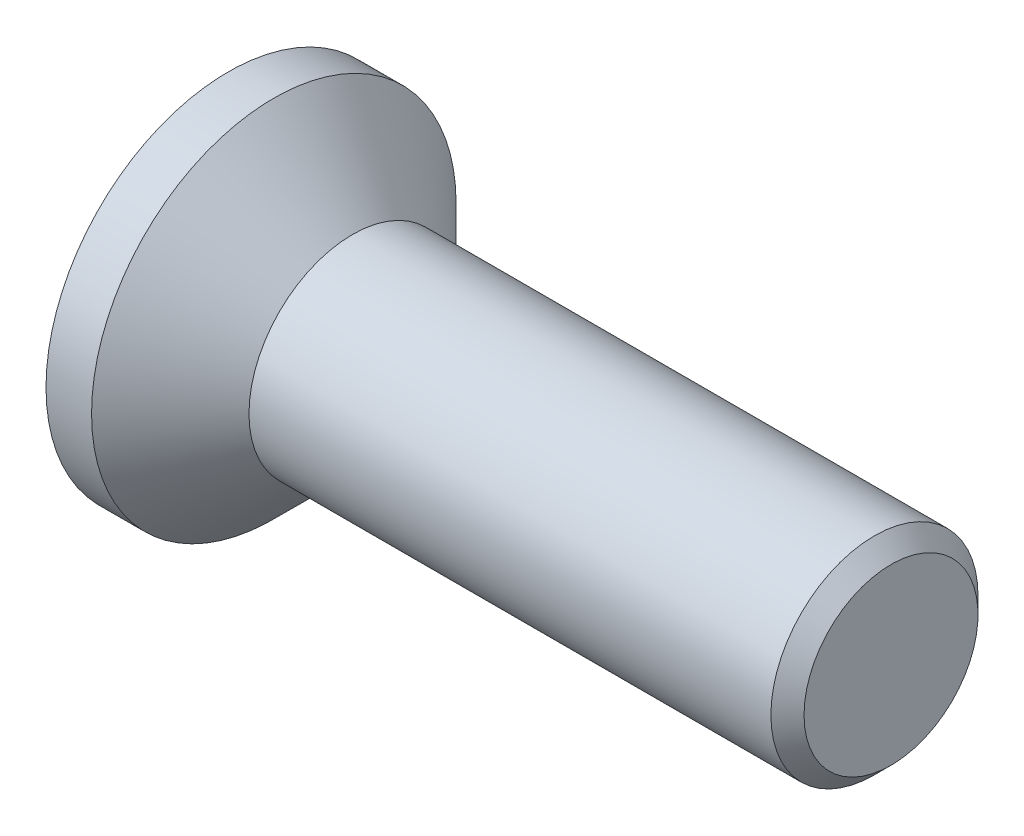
ISO-10303-21;
HEADER;
FILE_DESCRIPTION(('STEP AP214'),'2;1');
FILE_NAME('part.step','',(''),(''),'','','');
FILE_SCHEMA(('AUTOMOTIVE_DESIGN { 1 0 10303 214 1 1 1 1 }'));
ENDSEC;
DATA;
#1=APPLICATION_CONTEXT('core data for automotive mechanical design processes');
#2=APPLICATION_PROTOCOL_DEFINITION('international standard','automotive_design',2000,#1);
#3=PRODUCT_CONTEXT('',#1,'mechanical');
#4=PRODUCT('Part','Part','',(#3));
#5=PRODUCT_RELATED_PRODUCT_CATEGORY('part','',(#4));
#6=PRODUCT_DEFINITION_FORMATION('','',#4);
#7=PRODUCT_DEFINITION_CONTEXT('part definition',#1,'design');
#8=PRODUCT_DEFINITION('design','',#6,#7);
#9=PRODUCT_DEFINITION_SHAPE('','',#8);
#10=(LENGTH_UNIT() NAMED_UNIT(*) SI_UNIT(.MILLI.,.METRE.));
#11=(NAMED_UNIT(*) PLANE_ANGLE_UNIT() SI_UNIT($,.RADIAN.));
#12=(NAMED_UNIT(*) SI_UNIT($,.STERADIAN.) SOLID_ANGLE_UNIT());
#13=UNCERTAINTY_MEASURE_WITH_UNIT(LENGTH_MEASURE(1.E-05),#10,'distance_accuracy_value','');
#14=(GEOMETRIC_REPRESENTATION_CONTEXT(3) GLOBAL_UNCERTAINTY_ASSIGNED_CONTEXT((#13)) GLOBAL_UNIT_ASSIGNED_CONTEXT((#10,
#11,#12)) REPRESENTATION_CONTEXT('',''));
#15=CARTESIAN_POINT('',(0.,0.,0.));
#16=DIRECTION('',(0.,0.,1.));
#17=DIRECTION('',(1.,0.,0.));
#18=AXIS2_PLACEMENT_3D('',#15,#16,#17);
#19=CARTESIAN_POINT('',(4.51581291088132,0.,0.));
#20=DIRECTION('',(1.,0.,0.));
#21=DIRECTION('',(0.,0.,-1.));
#22=AXIS2_PLACEMENT_3D('',#19,#20,#21);
#23=CYLINDRICAL_SURFACE('',#22,1.25);
#24=CARTESIAN_POINT('',(7.8,0.,0.));
#25=DIRECTION('',(1.,0.,0.));
#26=DIRECTION('',(0.,0.,-1.));
#27=AXIS2_PLACEMENT_3D('',#24,#25,#26);
#28=CIRCLE('',#27,1.25);
#29=CARTESIAN_POINT('',(7.8,0.,1.25));
#30=VERTEX_POINT('',#29);
#31=EDGE_CURVE('E11',#30,#30,#28,.F.);
#32=ORIENTED_EDGE('',*,*,#31,.T.);
#33=EDGE_LOOP('',(#32));
#34=FACE_BOUND('',#33,.T.);
#35=CARTESIAN_POINT('',(1.50000000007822,0.,0.));
#36=DIRECTION('',(-1.,0.,0.));
#37=DIRECTION('',(0.,0.,1.));
#38=AXIS2_PLACEMENT_3D('',#35,#36,#37);
#39=CIRCLE('',#38,1.25000000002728);
#40=CARTESIAN_POINT('',(1.50000000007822,0.,1.25000000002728));
#41=VERTEX_POINT('',#40);
#42=EDGE_CURVE('E245',#41,#41,#39,.T.);
#43=ORIENTED_EDGE('',*,*,#42,.F.);
#44=EDGE_LOOP('',(#43));
#45=FACE_BOUND('',#44,.T.);
#46=ADVANCED_FACE('F39',(#34,#45),#23,.T.);
#47=CARTESIAN_POINT('',(0.550000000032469,0.,0.));
#48=DIRECTION('',(-1.,0.,0.));
#49=DIRECTION('',(0.,0.,1.));
#50=AXIS2_PLACEMENT_3D('',#47,#48,#49);
#51=CONICAL_SURFACE('',#50,2.20000000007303,0.785398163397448);
#52=ORIENTED_EDGE('',*,*,#42,.T.);
#53=EDGE_LOOP('',(#52));
#54=FACE_BOUND('',#53,.T.);
#55=CARTESIAN_POINT('',(0.550000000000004,0.,0.));
#56=DIRECTION('',(1.,0.,0.));
#57=DIRECTION('',(0.,0.,-1.));
#58=AXIS2_PLACEMENT_3D('',#55,#56,#57);
#59=CIRCLE('',#58,2.2);
#60=CARTESIAN_POINT('',(0.550000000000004,0.,-2.2));
#61=VERTEX_POINT('',#60);
#62=EDGE_CURVE('E186',#61,#61,#59,.F.);
#63=ORIENTED_EDGE('',*,*,#62,.F.);
#64=EDGE_LOOP('',(#63));
#65=FACE_BOUND('',#64,.T.);
#66=ADVANCED_FACE('F511',(#54,#65),#51,.T.);
#67=CARTESIAN_POINT('',(0.75,0.29,0.29));
#68=DIRECTION('',(1.,0.,0.));
#69=DIRECTION('',(0.,0.,-1.));
#70=AXIS2_PLACEMENT_3D('',#67,#68,#69);
#71=PLANE('',#70);
#72=CARTESIAN_POINT('',(0.75,0.59,0.59));
#73=DIRECTION('',(-1.,0.,0.));
#74=DIRECTION('',(0.,0.,1.));
#75=AXIS2_PLACEMENT_3D('',#72,#73,#74);
#76=CIRCLE('',#75,0.3);
#77=CARTESIAN_POINT('',(0.75,0.59,0.29));
#78=VERTEX_POINT('',#77);
#79=CARTESIAN_POINT('',(0.75,0.29,0.59));
#80=VERTEX_POINT('',#79);
#81=EDGE_CURVE('E271',#78,#80,#76,.T.);
#82=ORIENTED_EDGE('',*,*,#81,.F.);
#83=DIRECTION('',(0.,1.,0.));
#84=VECTOR('',#83,1.);
#85=CARTESIAN_POINT('',(0.75,0.29,0.29));
#86=LINE('',#85,#84);
#87=CARTESIAN_POINT('',(0.75,1.01698729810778,0.29));
#88=VERTEX_POINT('',#87);
#89=EDGE_CURVE('E215',#88,#78,#86,.F.);
#90=ORIENTED_EDGE('',*,*,#89,.F.);
#91=DIRECTION('',(0.,0.,1.));
#92=VECTOR('',#91,1.);
#93=CARTESIAN_POINT('',(0.75,1.01698729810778,-0.29));
#94=LINE('',#93,#92);
#95=CARTESIAN_POINT('',(0.75,1.01698729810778,-0.29));
#96=VERTEX_POINT('',#95);
#97=EDGE_CURVE('E219',#96,#88,#94,.T.);
#98=ORIENTED_EDGE('',*,*,#97,.F.);
#99=DIRECTION('',(0.,1.,0.));
#100=VECTOR('',#99,1.);
#101=CARTESIAN_POINT('',(0.75,0.29,-0.29));
#102=LINE('',#101,#100);
#103=CARTESIAN_POINT('',(0.75,0.59,-0.29));
#104=VERTEX_POINT('',#103);
#105=EDGE_CURVE('E227',#104,#96,#102,.T.);
#106=ORIENTED_EDGE('',*,*,#105,.F.);
#107=CARTESIAN_POINT('',(0.75,0.59,-0.59));
#108=DIRECTION('',(-1.,0.,0.));
#109=DIRECTION('',(0.,0.,1.));
#110=AXIS2_PLACEMENT_3D('',#107,#108,#109);
#111=CIRCLE('',#110,0.3);
#112=CARTESIAN_POINT('',(0.75,0.29,-0.59));
#113=VERTEX_POINT('',#112);
#114=EDGE_CURVE('E274',#113,#104,#111,.T.);
#115=ORIENTED_EDGE('',*,*,#114,.F.);
#116=DIRECTION('',(0.,0.,-1.));
#117=VECTOR('',#116,1.);
#118=CARTESIAN_POINT('',(0.75,0.29,-0.29));
#119=LINE('',#118,#117);
#120=CARTESIAN_POINT('',(0.75,0.29,-1.01698729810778));
#121=VERTEX_POINT('',#120);
#122=EDGE_CURVE('E232',#121,#113,#119,.F.);
#123=ORIENTED_EDGE('',*,*,#122,.F.);
#124=DIRECTION('',(0.,1.,0.));
#125=VECTOR('',#124,1.);
#126=CARTESIAN_POINT('',(0.75,0.29,-1.01698729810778));
#127=LINE('',#126,#125);
#128=CARTESIAN_POINT('',(0.75,-0.29,-1.01698729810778));
#129=VERTEX_POINT('',#128);
#130=EDGE_CURVE('E163',#129,#121,#127,.T.);
#131=ORIENTED_EDGE('',*,*,#130,.F.);
#132=DIRECTION('',(0.,0.,1.));
#133=VECTOR('',#132,1.);
#134=CARTESIAN_POINT('',(0.75,-0.29,-0.29));
#135=LINE('',#134,#133);
#136=CARTESIAN_POINT('',(0.75,-0.29,-0.59));
#137=VERTEX_POINT('',#136);
#138=EDGE_CURVE('E160',#137,#129,#135,.F.);
#139=ORIENTED_EDGE('',*,*,#138,.F.);
#140=CARTESIAN_POINT('',(0.75,-0.59,-0.59));
#141=DIRECTION('',(-1.,0.,0.));
#142=DIRECTION('',(0.,0.,1.));
#143=AXIS2_PLACEMENT_3D('',#140,#141,#142);
#144=CIRCLE('',#143,0.3);
#145=CARTESIAN_POINT('',(0.75,-0.59,-0.29));
#146=VERTEX_POINT('',#145);
#147=EDGE_CURVE('E147',#146,#137,#144,.T.);
#148=ORIENTED_EDGE('',*,*,#147,.F.);
#149=DIRECTION('',(0.,1.,0.));
#150=VECTOR('',#149,1.);
#151=CARTESIAN_POINT('',(0.75,-0.29,-0.29));
#152=LINE('',#151,#150);
#153=CARTESIAN_POINT('',(0.75,-1.01698729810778,-0.29));
#154=VERTEX_POINT('',#153);
#155=EDGE_CURVE('E157',#154,#146,#152,.T.);
#156=ORIENTED_EDGE('',*,*,#155,.F.);
#157=DIRECTION('',(0.,0.,1.));
#158=VECTOR('',#157,1.);
#159=CARTESIAN_POINT('',(0.75,-1.01698729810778,-0.29));
#160=LINE('',#159,#158);
#161=CARTESIAN_POINT('',(0.75,-1.01698729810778,0.29));
#162=VERTEX_POINT('',#161);
#163=EDGE_CURVE('E182',#162,#154,#160,.F.);
#164=ORIENTED_EDGE('',*,*,#163,.F.);
#165=DIRECTION('',(0.,1.,0.));
#166=VECTOR('',#165,1.);
#167=CARTESIAN_POINT('',(0.75,-0.29,0.29));
#168=LINE('',#167,#166);
#169=CARTESIAN_POINT('',(0.75,-0.59,0.29));
#170=VERTEX_POINT('',#169);
#171=EDGE_CURVE('E193',#170,#162,#168,.F.);
#172=ORIENTED_EDGE('',*,*,#171,.F.);
#173=CARTESIAN_POINT('',(0.75,-0.59,0.59));
#174=DIRECTION('',(-1.,0.,0.));
#175=DIRECTION('',(0.,0.,1.));
#176=AXIS2_PLACEMENT_3D('',#173,#174,#175);
#177=CIRCLE('',#176,0.3);
#178=CARTESIAN_POINT('',(0.75,-0.29,0.59));
#179=VERTEX_POINT('',#178);
#180=EDGE_CURVE('E268',#179,#170,#177,.T.);
#181=ORIENTED_EDGE('',*,*,#180,.F.);
#182=DIRECTION('',(0.,0.,1.));
#183=VECTOR('',#182,1.);
#184=CARTESIAN_POINT('',(0.75,-0.29,0.29));
#185=LINE('',#184,#183);
#186=CARTESIAN_POINT('',(0.75,-0.29,1.01698729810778));
#187=VERTEX_POINT('',#186);
#188=EDGE_CURVE('E198',#187,#179,#185,.F.);
#189=ORIENTED_EDGE('',*,*,#188,.F.);
#190=DIRECTION('',(0.,1.,0.));
#191=VECTOR('',#190,1.);
#192=CARTESIAN_POINT('',(0.75,0.29,1.01698729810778));
#193=LINE('',#192,#191);
#194=CARTESIAN_POINT('',(0.75,0.29,1.01698729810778));
#195=VERTEX_POINT('',#194);
#196=EDGE_CURVE('E202',#195,#187,#193,.F.);
#197=ORIENTED_EDGE('',*,*,#196,.F.);
#198=DIRECTION('',(0.,0.,-1.));
#199=VECTOR('',#198,1.);
#200=CARTESIAN_POINT('',(0.75,0.29,0.29));
#201=LINE('',#200,#199);
#202=EDGE_CURVE('E210',#80,#195,#201,.F.);
#203=ORIENTED_EDGE('',*,*,#202,.F.);
#204=EDGE_LOOP('',(#82,#90,#98,#106,#115,#123,#131,#139,#148,#156,#164,#172,#181,#189,#197,#203));
#205=FACE_BOUND('',#204,.T.);
#206=ADVANCED_FACE('F161',(#205),#71,.F.);
#207=CARTESIAN_POINT('',(4.51581291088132,0.,0.));
#208=DIRECTION('',(1.,0.,0.));
#209=DIRECTION('',(0.,0.,-1.));
#210=AXIS2_PLACEMENT_3D('',#207,#208,#209);
#211=CYLINDRICAL_SURFACE('',#210,2.2);
#212=CARTESIAN_POINT('',(0.,0.,0.));
#213=DIRECTION('',(1.,0.,0.));
#214=DIRECTION('',(0.,0.,-1.));
#215=AXIS2_PLACEMENT_3D('',#212,#213,#214);
#216=CIRCLE('',#215,2.2);
#217=CARTESIAN_POINT('',(0.,0.,-2.2));
#218=VERTEX_POINT('',#217);
#219=EDGE_CURVE('E181',#218,#218,#216,.F.);
#220=ORIENTED_EDGE('',*,*,#219,.F.);
#221=EDGE_LOOP('',(#220));
#222=FACE_BOUND('',#221,.T.);
#223=ORIENTED_EDGE('',*,*,#62,.T.);
#224=EDGE_LOOP('',(#223));
#225=FACE_BOUND('',#224,.T.);
#226=ADVANCED_FACE('F482',(#222,#225),#211,.T.);
#227=CARTESIAN_POINT('',(0.75,-0.29,-0.29));
#228=DIRECTION('',(0.,0.,1.));
#229=DIRECTION('',(1.,0.,0.));
#230=AXIS2_PLACEMENT_3D('',#227,#228,#229);
#231=PLANE('',#230);
#232=DIRECTION('',(0.,1.,0.));
#233=VECTOR('',#232,1.);
#234=CARTESIAN_POINT('',(0.,2.2,-0.29));
#235=LINE('',#234,#233);
#236=CARTESIAN_POINT('',(0.,-1.45,-0.29));
#237=VERTEX_POINT('',#236);
#238=CARTESIAN_POINT('',(0.,-0.59,-0.29));
#239=VERTEX_POINT('',#238);
#240=EDGE_CURVE('E265',#237,#239,#235,.T.);
#241=ORIENTED_EDGE('',*,*,#240,.F.);
#242=DIRECTION('',(-0.866025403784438,-0.500000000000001,0.));
#243=VECTOR('',#242,1.);
#244=CARTESIAN_POINT('',(0.,-1.45,-0.29));
#245=LINE('',#244,#243);
#246=EDGE_CURVE('E178',#154,#237,#245,.T.);
#247=ORIENTED_EDGE('',*,*,#246,.F.);
#248=ORIENTED_EDGE('',*,*,#155,.T.);
#249=DIRECTION('',(-1.,0.,0.));
#250=VECTOR('',#249,1.);
#251=CARTESIAN_POINT('',(0.75,-0.59,-0.29));
#252=LINE('',#251,#250);
#253=EDGE_CURVE('E156',#239,#146,#252,.F.);
#254=ORIENTED_EDGE('',*,*,#253,.F.);
#255=EDGE_LOOP('',(#241,#247,#248,#254));
#256=FACE_BOUND('',#255,.T.);
#257=ADVANCED_FACE('F356',(#256),#231,.T.);
#258=CARTESIAN_POINT('',(0.75,-0.59,-0.59));
#259=DIRECTION('',(-1.,0.,0.));
#260=DIRECTION('',(0.,0.,1.));
#261=AXIS2_PLACEMENT_3D('',#258,#259,#260);
#262=CYLINDRICAL_SURFACE('',#261,0.3);
#263=CARTESIAN_POINT('',(0.,-0.59,-0.59));
#264=DIRECTION('',(-1.,0.,0.));
#265=DIRECTION('',(0.,0.,1.));
#266=AXIS2_PLACEMENT_3D('',#263,#264,#265);
#267=CIRCLE('',#266,0.3);
#268=CARTESIAN_POINT('',(0.,-0.29,-0.59));
#269=VERTEX_POINT('',#268);
#270=EDGE_CURVE('E263',#239,#269,#267,.T.);
#271=ORIENTED_EDGE('',*,*,#270,.F.);
#272=ORIENTED_EDGE('',*,*,#253,.T.);
#273=ORIENTED_EDGE('',*,*,#147,.T.);
#274=DIRECTION('',(1.,0.,0.));
#275=VECTOR('',#274,1.);
#276=CARTESIAN_POINT('',(0.75,-0.29,-0.59));
#277=LINE('',#276,#275);
#278=EDGE_CURVE('E154',#269,#137,#277,.T.);
#279=ORIENTED_EDGE('',*,*,#278,.F.);
#280=EDGE_LOOP('',(#271,#272,#273,#279));
#281=FACE_BOUND('',#280,.T.);
#282=ADVANCED_FACE('F152',(#281),#262,.T.);
#283=CARTESIAN_POINT('',(0.75,-0.29,-0.29));
#284=DIRECTION('',(0.,1.,0.));
#285=DIRECTION('',(0.,0.,1.));
#286=AXIS2_PLACEMENT_3D('',#283,#284,#285);
#287=PLANE('',#286);
#288=ORIENTED_EDGE('',*,*,#138,.T.);
#289=DIRECTION('',(0.866025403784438,0.,0.500000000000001));
#290=VECTOR('',#289,1.);
#291=CARTESIAN_POINT('',(0.,-0.29,-1.45));
#292=LINE('',#291,#290);
#293=CARTESIAN_POINT('',(0.,-0.29,-1.45));
#294=VERTEX_POINT('',#293);
#295=EDGE_CURVE('E166',#294,#129,#292,.T.);
#296=ORIENTED_EDGE('',*,*,#295,.F.);
#297=DIRECTION('',(0.,0.,1.));
#298=VECTOR('',#297,1.);
#299=CARTESIAN_POINT('',(0.,-0.29,0.));
#300=LINE('',#299,#298);
#301=EDGE_CURVE('E170',#269,#294,#300,.F.);
#302=ORIENTED_EDGE('',*,*,#301,.F.);
#303=ORIENTED_EDGE('',*,*,#278,.T.);
#304=EDGE_LOOP('',(#288,#296,#302,#303));
#305=FACE_BOUND('',#304,.T.);
#306=ADVANCED_FACE('F168',(#305),#287,.T.);
#307=CARTESIAN_POINT('',(0.,0.29,-1.45));
#308=DIRECTION('',(-0.500000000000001,0.,0.866025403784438));
#309=DIRECTION('',(0.866025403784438,0.,0.500000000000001));
#310=AXIS2_PLACEMENT_3D('',#307,#308,#309);
#311=PLANE('',#310);
#312=ORIENTED_EDGE('',*,*,#130,.T.);
#313=DIRECTION('',(0.866025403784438,0.,0.500000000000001));
#314=VECTOR('',#313,1.);
#315=CARTESIAN_POINT('',(0.,0.29,-1.45));
#316=LINE('',#315,#314);
#317=CARTESIAN_POINT('',(0.,0.29,-1.45));
#318=VERTEX_POINT('',#317);
#319=EDGE_CURVE('E235',#318,#121,#316,.T.);
#320=ORIENTED_EDGE('',*,*,#319,.F.);
#321=DIRECTION('',(0.,1.,0.));
#322=VECTOR('',#321,1.);
#323=CARTESIAN_POINT('',(0.,2.2,-1.45));
#324=LINE('',#323,#322);
#325=EDGE_CURVE('E334',#294,#318,#324,.T.);
#326=ORIENTED_EDGE('',*,*,#325,.F.);
#327=ORIENTED_EDGE('',*,*,#295,.T.);
#328=EDGE_LOOP('',(#312,#320,#326,#327));
#329=FACE_BOUND('',#328,.T.);
#330=ADVANCED_FACE('F340',(#329),#311,.T.);
#331=CARTESIAN_POINT('',(0.75,0.29,-0.29));
#332=DIRECTION('',(0.,-1.,0.));
#333=DIRECTION('',(0.,0.,-1.));
#334=AXIS2_PLACEMENT_3D('',#331,#332,#333);
#335=PLANE('',#334);
#336=DIRECTION('',(0.,0.,1.));
#337=VECTOR('',#336,1.);
#338=CARTESIAN_POINT('',(0.,0.29,0.));
#339=LINE('',#338,#337);
#340=CARTESIAN_POINT('',(0.,0.29,-0.59));
#341=VERTEX_POINT('',#340);
#342=EDGE_CURVE('E262',#318,#341,#339,.T.);
#343=ORIENTED_EDGE('',*,*,#342,.F.);
#344=ORIENTED_EDGE('',*,*,#319,.T.);
#345=ORIENTED_EDGE('',*,*,#122,.T.);
#346=DIRECTION('',(-1.,0.,0.));
#347=VECTOR('',#346,1.);
#348=CARTESIAN_POINT('',(0.75,0.29,-0.59));
#349=LINE('',#348,#347);
#350=EDGE_CURVE('E275',#341,#113,#349,.F.);
#351=ORIENTED_EDGE('',*,*,#350,.F.);
#352=EDGE_LOOP('',(#343,#344,#345,#351));
#353=FACE_BOUND('',#352,.T.);
#354=ADVANCED_FACE('F400',(#353),#335,.T.);
#355=CARTESIAN_POINT('',(0.75,0.59,-0.59));
#356=DIRECTION('',(-1.,0.,0.));
#357=DIRECTION('',(0.,0.,1.));
#358=AXIS2_PLACEMENT_3D('',#355,#356,#357);
#359=CYLINDRICAL_SURFACE('',#358,0.3);
#360=CARTESIAN_POINT('',(0.,0.59,-0.59));
#361=DIRECTION('',(-1.,0.,0.));
#362=DIRECTION('',(0.,0.,1.));
#363=AXIS2_PLACEMENT_3D('',#360,#361,#362);
#364=CIRCLE('',#363,0.3);
#365=CARTESIAN_POINT('',(0.,0.59,-0.29));
#366=VERTEX_POINT('',#365);
#367=EDGE_CURVE('E258',#341,#366,#364,.T.);
#368=ORIENTED_EDGE('',*,*,#367,.F.);
#369=ORIENTED_EDGE('',*,*,#350,.T.);
#370=ORIENTED_EDGE('',*,*,#114,.T.);
#371=DIRECTION('',(1.,0.,0.));
#372=VECTOR('',#371,1.);
#373=CARTESIAN_POINT('',(0.75,0.59,-0.29));
#374=LINE('',#373,#372);
#375=EDGE_CURVE('E229',#366,#104,#374,.T.);
#376=ORIENTED_EDGE('',*,*,#375,.F.);
#377=EDGE_LOOP('',(#368,#369,#370,#376));
#378=FACE_BOUND('',#377,.T.);
#379=ADVANCED_FACE('F402',(#378),#359,.T.);
#380=CARTESIAN_POINT('',(0.75,0.29,-0.29));
#381=DIRECTION('',(0.,0.,1.));
#382=DIRECTION('',(1.,0.,0.));
#383=AXIS2_PLACEMENT_3D('',#380,#381,#382);
#384=PLANE('',#383);
#385=ORIENTED_EDGE('',*,*,#105,.T.);
#386=DIRECTION('',(0.866025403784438,-0.500000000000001,0.));
#387=VECTOR('',#386,1.);
#388=CARTESIAN_POINT('',(0.,1.45,-0.29));
#389=LINE('',#388,#387);
#390=CARTESIAN_POINT('',(0.,1.45,-0.29));
#391=VERTEX_POINT('',#390);
#392=EDGE_CURVE('E224',#391,#96,#389,.T.);
#393=ORIENTED_EDGE('',*,*,#392,.F.);
#394=DIRECTION('',(0.,1.,0.));
#395=VECTOR('',#394,1.);
#396=CARTESIAN_POINT('',(0.,2.2,-0.29));
#397=LINE('',#396,#395);
#398=EDGE_CURVE('E261',#366,#391,#397,.T.);
#399=ORIENTED_EDGE('',*,*,#398,.F.);
#400=ORIENTED_EDGE('',*,*,#375,.T.);
#401=EDGE_LOOP('',(#385,#393,#399,#400));
#402=FACE_BOUND('',#401,.T.);
#403=ADVANCED_FACE('F406',(#402),#384,.T.);
#404=CARTESIAN_POINT('',(0.,1.45,-0.29));
#405=DIRECTION('',(-0.500000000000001,-0.866025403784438,0.));
#406=DIRECTION('',(0.866025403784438,-0.500000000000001,0.));
#407=AXIS2_PLACEMENT_3D('',#404,#405,#406);
#408=PLANE('',#407);
#409=ORIENTED_EDGE('',*,*,#97,.T.);
#410=DIRECTION('',(0.866025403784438,-0.500000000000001,0.));
#411=VECTOR('',#410,1.);
#412=CARTESIAN_POINT('',(0.,1.45,0.29));
#413=LINE('',#412,#411);
#414=CARTESIAN_POINT('',(0.,1.45,0.29));
#415=VERTEX_POINT('',#414);
#416=EDGE_CURVE('E218',#415,#88,#413,.T.);
#417=ORIENTED_EDGE('',*,*,#416,.F.);
#418=DIRECTION('',(0.,0.,1.));
#419=VECTOR('',#418,1.);
#420=CARTESIAN_POINT('',(0.,1.45,0.));
#421=LINE('',#420,#419);
#422=EDGE_CURVE('E317',#391,#415,#421,.T.);
#423=ORIENTED_EDGE('',*,*,#422,.F.);
#424=ORIENTED_EDGE('',*,*,#392,.T.);
#425=EDGE_LOOP('',(#409,#417,#423,#424));
#426=FACE_BOUND('',#425,.T.);
#427=ADVANCED_FACE('F408',(#426),#408,.T.);
#428=CARTESIAN_POINT('',(0.75,0.29,0.29));
#429=DIRECTION('',(0.,0.,-1.));
#430=DIRECTION('',(0.,1.,0.));
#431=AXIS2_PLACEMENT_3D('',#428,#429,#430);
#432=PLANE('',#431);
#433=DIRECTION('',(0.,1.,0.));
#434=VECTOR('',#433,1.);
#435=CARTESIAN_POINT('',(0.,2.2,0.29));
#436=LINE('',#435,#434);
#437=CARTESIAN_POINT('',(0.,0.59,0.29));
#438=VERTEX_POINT('',#437);
#439=EDGE_CURVE('E257',#415,#438,#436,.F.);
#440=ORIENTED_EDGE('',*,*,#439,.F.);
#441=ORIENTED_EDGE('',*,*,#416,.T.);
#442=ORIENTED_EDGE('',*,*,#89,.T.);
#443=DIRECTION('',(-1.,0.,0.));
#444=VECTOR('',#443,1.);
#445=CARTESIAN_POINT('',(0.75,0.59,0.29));
#446=LINE('',#445,#444);
#447=EDGE_CURVE('E273',#438,#78,#446,.F.);
#448=ORIENTED_EDGE('',*,*,#447,.F.);
#449=EDGE_LOOP('',(#440,#441,#442,#448));
#450=FACE_BOUND('',#449,.T.);
#451=ADVANCED_FACE('F383',(#450),#432,.T.);
#452=CARTESIAN_POINT('',(0.75,0.59,0.59));
#453=DIRECTION('',(-1.,0.,0.));
#454=DIRECTION('',(0.,0.,1.));
#455=AXIS2_PLACEMENT_3D('',#452,#453,#454);
#456=CYLINDRICAL_SURFACE('',#455,0.3);
#457=CARTESIAN_POINT('',(0.,0.59,0.59));
#458=DIRECTION('',(-1.,0.,0.));
#459=DIRECTION('',(0.,0.,1.));
#460=AXIS2_PLACEMENT_3D('',#457,#458,#459);
#461=CIRCLE('',#460,0.3);
#462=CARTESIAN_POINT('',(0.,0.29,0.59));
#463=VERTEX_POINT('',#462);
#464=EDGE_CURVE('E253',#438,#463,#461,.T.);
#465=ORIENTED_EDGE('',*,*,#464,.F.);
#466=ORIENTED_EDGE('',*,*,#447,.T.);
#467=ORIENTED_EDGE('',*,*,#81,.T.);
#468=DIRECTION('',(1.,0.,0.));
#469=VECTOR('',#468,1.);
#470=CARTESIAN_POINT('',(0.75,0.29,0.59));
#471=LINE('',#470,#469);
#472=EDGE_CURVE('E212',#463,#80,#471,.T.);
#473=ORIENTED_EDGE('',*,*,#472,.F.);
#474=EDGE_LOOP('',(#465,#466,#467,#473));
#475=FACE_BOUND('',#474,.T.);
#476=ADVANCED_FACE('F385',(#475),#456,.T.);
#477=CARTESIAN_POINT('',(0.75,0.29,0.29));
#478=DIRECTION('',(0.,-1.,0.));
#479=DIRECTION('',(0.,0.,-1.));
#480=AXIS2_PLACEMENT_3D('',#477,#478,#479);
#481=PLANE('',#480);
#482=ORIENTED_EDGE('',*,*,#202,.T.);
#483=DIRECTION('',(-0.866025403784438,0.,0.500000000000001));
#484=VECTOR('',#483,1.);
#485=CARTESIAN_POINT('',(0.,0.29,1.45));
#486=LINE('',#485,#484);
#487=CARTESIAN_POINT('',(0.,0.29,1.45));
#488=VERTEX_POINT('',#487);
#489=EDGE_CURVE('E207',#488,#195,#486,.F.);
#490=ORIENTED_EDGE('',*,*,#489,.F.);
#491=DIRECTION('',(0.,0.,1.));
#492=VECTOR('',#491,1.);
#493=CARTESIAN_POINT('',(0.,0.29,0.));
#494=LINE('',#493,#492);
#495=EDGE_CURVE('E256',#463,#488,#494,.T.);
#496=ORIENTED_EDGE('',*,*,#495,.F.);
#497=ORIENTED_EDGE('',*,*,#472,.T.);
#498=EDGE_LOOP('',(#482,#490,#496,#497));
#499=FACE_BOUND('',#498,.T.);
#500=ADVANCED_FACE('F378',(#499),#481,.T.);
#501=CARTESIAN_POINT('',(0.,0.29,1.45));
#502=DIRECTION('',(-0.500000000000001,0.,-0.866025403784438));
#503=DIRECTION('',(-0.866025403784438,0.,0.500000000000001));
#504=AXIS2_PLACEMENT_3D('',#501,#502,#503);
#505=PLANE('',#504);
#506=ORIENTED_EDGE('',*,*,#196,.T.);
#507=DIRECTION('',(0.866025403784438,0.,-0.500000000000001));
#508=VECTOR('',#507,1.);
#509=CARTESIAN_POINT('',(0.,-0.29,1.45));
#510=LINE('',#509,#508);
#511=CARTESIAN_POINT('',(0.,-0.29,1.45));
#512=VERTEX_POINT('',#511);
#513=EDGE_CURVE('E201',#512,#187,#510,.T.);
#514=ORIENTED_EDGE('',*,*,#513,.F.);
#515=DIRECTION('',(0.,1.,0.));
#516=VECTOR('',#515,1.);
#517=CARTESIAN_POINT('',(0.,2.2,1.45));
#518=LINE('',#517,#516);
#519=EDGE_CURVE('E300',#488,#512,#518,.F.);
#520=ORIENTED_EDGE('',*,*,#519,.F.);
#521=ORIENTED_EDGE('',*,*,#489,.T.);
#522=EDGE_LOOP('',(#506,#514,#520,#521));
#523=FACE_BOUND('',#522,.T.);
#524=ADVANCED_FACE('F373',(#523),#505,.T.);
#525=CARTESIAN_POINT('',(0.75,-0.29,0.29));
#526=DIRECTION('',(0.,1.,0.));
#527=DIRECTION('',(0.,0.,1.));
#528=AXIS2_PLACEMENT_3D('',#525,#526,#527);
#529=PLANE('',#528);
#530=DIRECTION('',(0.,0.,1.));
#531=VECTOR('',#530,1.);
#532=CARTESIAN_POINT('',(0.,-0.29,0.));
#533=LINE('',#532,#531);
#534=CARTESIAN_POINT('',(0.,-0.29,0.59));
#535=VERTEX_POINT('',#534);
#536=EDGE_CURVE('E252',#512,#535,#533,.F.);
#537=ORIENTED_EDGE('',*,*,#536,.F.);
#538=ORIENTED_EDGE('',*,*,#513,.T.);
#539=ORIENTED_EDGE('',*,*,#188,.T.);
#540=DIRECTION('',(-1.,0.,0.));
#541=VECTOR('',#540,1.);
#542=CARTESIAN_POINT('',(0.75,-0.29,0.59));
#543=LINE('',#542,#541);
#544=EDGE_CURVE('E270',#535,#179,#543,.F.);
#545=ORIENTED_EDGE('',*,*,#544,.F.);
#546=EDGE_LOOP('',(#537,#538,#539,#545));
#547=FACE_BOUND('',#546,.T.);
#548=ADVANCED_FACE('F369',(#547),#529,.T.);
#549=CARTESIAN_POINT('',(0.75,-0.59,0.59));
#550=DIRECTION('',(-1.,0.,0.));
#551=DIRECTION('',(0.,0.,1.));
#552=AXIS2_PLACEMENT_3D('',#549,#550,#551);
#553=CYLINDRICAL_SURFACE('',#552,0.3);
#554=CARTESIAN_POINT('',(0.,-0.59,0.59));
#555=DIRECTION('',(-1.,0.,0.));
#556=DIRECTION('',(0.,0.,1.));
#557=AXIS2_PLACEMENT_3D('',#554,#555,#556);
#558=CIRCLE('',#557,0.3);
#559=CARTESIAN_POINT('',(0.,-0.59,0.29));
#560=VERTEX_POINT('',#559);
#561=EDGE_CURVE('E248',#535,#560,#558,.T.);
#562=ORIENTED_EDGE('',*,*,#561,.F.);
#563=ORIENTED_EDGE('',*,*,#544,.T.);
#564=ORIENTED_EDGE('',*,*,#180,.T.);
#565=DIRECTION('',(1.,0.,0.));
#566=VECTOR('',#565,1.);
#567=CARTESIAN_POINT('',(0.75,-0.59,0.29));
#568=LINE('',#567,#566);
#569=EDGE_CURVE('E195',#560,#170,#568,.T.);
#570=ORIENTED_EDGE('',*,*,#569,.F.);
#571=EDGE_LOOP('',(#562,#563,#564,#570));
#572=FACE_BOUND('',#571,.T.);
#573=ADVANCED_FACE('F365',(#572),#553,.T.);
#574=CARTESIAN_POINT('',(0.75,-0.29,0.29));
#575=DIRECTION('',(0.,0.,-1.));
#576=DIRECTION('',(0.,1.,0.));
#577=AXIS2_PLACEMENT_3D('',#574,#575,#576);
#578=PLANE('',#577);
#579=ORIENTED_EDGE('',*,*,#171,.T.);
#580=DIRECTION('',(-0.866025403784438,-0.500000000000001,0.));
#581=VECTOR('',#580,1.);
#582=CARTESIAN_POINT('',(0.,-1.45,0.289999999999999));
#583=LINE('',#582,#581);
#584=CARTESIAN_POINT('',(0.,-1.45,0.29));
#585=VERTEX_POINT('',#584);
#586=EDGE_CURVE('E56',#585,#162,#583,.F.);
#587=ORIENTED_EDGE('',*,*,#586,.F.);
#588=DIRECTION('',(0.,1.,0.));
#589=VECTOR('',#588,1.);
#590=CARTESIAN_POINT('',(0.,2.2,0.29));
#591=LINE('',#590,#589);
#592=EDGE_CURVE('E251',#560,#585,#591,.F.);
#593=ORIENTED_EDGE('',*,*,#592,.F.);
#594=ORIENTED_EDGE('',*,*,#569,.T.);
#595=EDGE_LOOP('',(#579,#587,#593,#594));
#596=FACE_BOUND('',#595,.T.);
#597=ADVANCED_FACE('F362',(#596),#578,.T.);
#598=CARTESIAN_POINT('',(0.,-1.45,-0.29));
#599=DIRECTION('',(-0.500000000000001,0.866025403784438,0.));
#600=DIRECTION('',(-0.866025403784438,-0.500000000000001,0.));
#601=AXIS2_PLACEMENT_3D('',#598,#599,#600);
#602=PLANE('',#601);
#603=ORIENTED_EDGE('',*,*,#163,.T.);
#604=ORIENTED_EDGE('',*,*,#246,.T.);
#605=DIRECTION('',(0.,0.,1.));
#606=VECTOR('',#605,1.);
#607=CARTESIAN_POINT('',(0.,-1.45,0.));
#608=LINE('',#607,#606);
#609=EDGE_CURVE('E277',#585,#237,#608,.F.);
#610=ORIENTED_EDGE('',*,*,#609,.F.);
#611=ORIENTED_EDGE('',*,*,#586,.T.);
#612=EDGE_LOOP('',(#603,#604,#610,#611));
#613=FACE_BOUND('',#612,.T.);
#614=ADVANCED_FACE('F358',(#613),#602,.T.);
#615=CARTESIAN_POINT('',(0.,2.2,0.));
#616=DIRECTION('',(-1.,0.,0.));
#617=DIRECTION('',(0.,0.,1.));
#618=AXIS2_PLACEMENT_3D('',#615,#616,#617);
#619=PLANE('',#618);
#620=ORIENTED_EDGE('',*,*,#592,.T.);
#621=ORIENTED_EDGE('',*,*,#609,.T.);
#622=ORIENTED_EDGE('',*,*,#240,.T.);
#623=ORIENTED_EDGE('',*,*,#270,.T.);
#624=ORIENTED_EDGE('',*,*,#301,.T.);
#625=ORIENTED_EDGE('',*,*,#325,.T.);
#626=ORIENTED_EDGE('',*,*,#342,.T.);
#627=ORIENTED_EDGE('',*,*,#367,.T.);
#628=ORIENTED_EDGE('',*,*,#398,.T.);
#629=ORIENTED_EDGE('',*,*,#422,.T.);
#630=ORIENTED_EDGE('',*,*,#439,.T.);
#631=ORIENTED_EDGE('',*,*,#464,.T.);
#632=ORIENTED_EDGE('',*,*,#495,.T.);
#633=ORIENTED_EDGE('',*,*,#519,.T.);
#634=ORIENTED_EDGE('',*,*,#536,.T.);
#635=ORIENTED_EDGE('',*,*,#561,.T.);
#636=EDGE_LOOP('',(#620,#621,#622,#623,#624,#625,#626,#627,#628,#629,#630,#631,#632,#633,#634,#635));
#637=FACE_BOUND('',#636,.T.);
#638=ORIENTED_EDGE('',*,*,#219,.T.);
#639=EDGE_LOOP('',(#638));
#640=FACE_BOUND('',#639,.T.);
#641=ADVANCED_FACE('F343',(#637,#640),#619,.T.);
#642=CARTESIAN_POINT('',(8.,0.,0.));
#643=DIRECTION('',(1.,0.,0.));
#644=DIRECTION('',(0.,0.,-1.));
#645=AXIS2_PLACEMENT_3D('',#642,#643,#644);
#646=PLANE('',#645);
#647=CARTESIAN_POINT('',(8.,0.,0.));
#648=DIRECTION('',(1.,0.,0.));
#649=DIRECTION('',(0.,0.,-1.));
#650=AXIS2_PLACEMENT_3D('',#647,#648,#649);
#651=CIRCLE('',#650,1.05);
#652=CARTESIAN_POINT('',(8.,0.,1.05));
#653=VERTEX_POINT('',#652);
#654=EDGE_CURVE('E48',#653,#653,#651,.T.);
#655=ORIENTED_EDGE('',*,*,#654,.T.);
#656=EDGE_LOOP('',(#655));
#657=FACE_BOUND('',#656,.T.);
#658=ADVANCED_FACE('F418',(#657),#646,.T.);
#659=CARTESIAN_POINT('',(8.,0.,0.));
#660=DIRECTION('',(-1.,0.,0.));
#661=DIRECTION('',(0.,0.,1.));
#662=AXIS2_PLACEMENT_3D('',#659,#660,#661);
#663=CONICAL_SURFACE('',#662,1.05,0.785398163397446);
#664=CARTESIAN_POINT('',(7.8,0.,1.25));
#665=CARTESIAN_POINT('',(7.80208333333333,0.,1.24791666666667));
#666=CARTESIAN_POINT('',(7.80416666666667,0.,1.24583333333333));
#667=CARTESIAN_POINT('',(7.80833333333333,0.,1.24166666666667));
#668=CARTESIAN_POINT('',(7.81041666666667,0.,1.23958333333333));
#669=CARTESIAN_POINT('',(7.81458333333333,0.,1.23541666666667));
#670=CARTESIAN_POINT('',(7.81666666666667,0.,1.23333333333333));
#671=CARTESIAN_POINT('',(7.82083333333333,0.,1.22916666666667));
#672=CARTESIAN_POINT('',(7.82291666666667,0.,1.22708333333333));
#673=CARTESIAN_POINT('',(7.82708333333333,0.,1.22291666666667));
#674=CARTESIAN_POINT('',(7.82916666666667,0.,1.22083333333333));
#675=CARTESIAN_POINT('',(7.83333333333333,0.,1.21666666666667));
#676=CARTESIAN_POINT('',(7.83541666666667,0.,1.21458333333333));
#677=CARTESIAN_POINT('',(7.83958333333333,0.,1.21041666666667));
#678=CARTESIAN_POINT('',(7.84166666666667,0.,1.20833333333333));
#679=CARTESIAN_POINT('',(7.84583333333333,0.,1.20416666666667));
#680=CARTESIAN_POINT('',(7.84791666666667,0.,1.20208333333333));
#681=CARTESIAN_POINT('',(7.85208333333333,0.,1.19791666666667));
#682=CARTESIAN_POINT('',(7.85416666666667,0.,1.19583333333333));
#683=CARTESIAN_POINT('',(7.85833333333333,0.,1.19166666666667));
#684=CARTESIAN_POINT('',(7.86041666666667,0.,1.18958333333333));
#685=CARTESIAN_POINT('',(7.86458333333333,0.,1.18541666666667));
#686=CARTESIAN_POINT('',(7.86666666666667,0.,1.18333333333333));
#687=CARTESIAN_POINT('',(7.87083333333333,0.,1.17916666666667));
#688=CARTESIAN_POINT('',(7.87291666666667,0.,1.17708333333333));
#689=CARTESIAN_POINT('',(7.87708333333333,0.,1.17291666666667));
#690=CARTESIAN_POINT('',(7.87916666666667,0.,1.17083333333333));
#691=CARTESIAN_POINT('',(7.88333333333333,0.,1.16666666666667));
#692=CARTESIAN_POINT('',(7.88541666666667,0.,1.16458333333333));
#693=CARTESIAN_POINT('',(7.88958333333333,0.,1.16041666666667));
#694=CARTESIAN_POINT('',(7.89166666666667,0.,1.15833333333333));
#695=CARTESIAN_POINT('',(7.89583333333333,0.,1.15416666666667));
#696=CARTESIAN_POINT('',(7.89791666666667,0.,1.15208333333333));
#697=CARTESIAN_POINT('',(7.90208333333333,0.,1.14791666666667));
#698=CARTESIAN_POINT('',(7.90416666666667,0.,1.14583333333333));
#699=CARTESIAN_POINT('',(7.90833333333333,0.,1.14166666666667));
#700=CARTESIAN_POINT('',(7.91041666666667,0.,1.13958333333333));
#701=CARTESIAN_POINT('',(7.91458333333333,0.,1.13541666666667));
#702=CARTESIAN_POINT('',(7.91666666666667,0.,1.13333333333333));
#703=CARTESIAN_POINT('',(7.92083333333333,0.,1.12916666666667));
#704=CARTESIAN_POINT('',(7.92291666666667,0.,1.12708333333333));
#705=CARTESIAN_POINT('',(7.92708333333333,0.,1.12291666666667));
#706=CARTESIAN_POINT('',(7.92916666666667,0.,1.12083333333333));
#707=CARTESIAN_POINT('',(7.93333333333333,0.,1.11666666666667));
#708=CARTESIAN_POINT('',(7.93541666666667,0.,1.11458333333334));
#709=CARTESIAN_POINT('',(7.93958333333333,0.,1.11041666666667));
#710=CARTESIAN_POINT('',(7.94166666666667,0.,1.10833333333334));
#711=CARTESIAN_POINT('',(7.94583333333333,0.,1.10416666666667));
#712=CARTESIAN_POINT('',(7.94791666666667,0.,1.10208333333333));
#713=CARTESIAN_POINT('',(7.95208333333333,0.,1.09791666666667));
#714=CARTESIAN_POINT('',(7.95416666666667,0.,1.09583333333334));
#715=CARTESIAN_POINT('',(7.95833333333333,0.,1.09166666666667));
#716=CARTESIAN_POINT('',(7.96041666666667,0.,1.08958333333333));
#717=CARTESIAN_POINT('',(7.96458333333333,0.,1.08541666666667));
#718=CARTESIAN_POINT('',(7.96666666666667,0.,1.08333333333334));
#719=CARTESIAN_POINT('',(7.97083333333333,0.,1.07916666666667));
#720=CARTESIAN_POINT('',(7.97291666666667,0.,1.07708333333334));
#721=CARTESIAN_POINT('',(7.97708333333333,0.,1.07291666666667));
#722=CARTESIAN_POINT('',(7.97916666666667,0.,1.07083333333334));
#723=CARTESIAN_POINT('',(7.98333333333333,0.,1.06666666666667));
#724=CARTESIAN_POINT('',(7.98541666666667,0.,1.06458333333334));
#725=CARTESIAN_POINT('',(7.98958333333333,0.,1.06041666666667));
#726=CARTESIAN_POINT('',(7.99166666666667,0.,1.05833333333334));
#727=CARTESIAN_POINT('',(7.99583333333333,0.,1.05416666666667));
#728=CARTESIAN_POINT('',(7.99791666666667,0.,1.05208333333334));
#729=CARTESIAN_POINT('',(8.,0.,1.05));
#730=B_SPLINE_CURVE_WITH_KNOTS('',3,(#664,#665,#666,#667,#668,#669,#670,#671,#672,#673,#674,
#675,#676,#677,#678,#679,#680,#681,#682,#683,#684,#685,#686,#687,#688,#689,#690,#691,#692,#693,
#694,#695,#696,#697,#698,#699,#700,#701,#702,#703,#704,#705,#706,#707,#708,#709,#710,#711,#712,
#713,#714,#715,#716,#717,#718,#719,#720,#721,#722,#723,#724,#725,#726,#727,#728,#729),
.UNSPECIFIED.,.F.,.F.,(4,2,2,2,2,2,2,2,2,2,2,2,2,2,2,2,2,2,2,2,2,2,2,2,2,2,2,2,2,2,2,2,4),(0.,
0.00883883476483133,0.0176776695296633,0.0265165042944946,0.0353553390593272,0.0441941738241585,
0.0530330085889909,0.0618718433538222,0.0707106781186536,0.0795495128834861,0.0883883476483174,
0.0972271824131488,0.106066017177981,0.114904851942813,0.123743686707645,0.132582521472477,
0.141421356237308,0.15026019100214,0.159099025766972,0.167937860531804,0.176776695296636,
0.185615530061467,0.194454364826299,0.203293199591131,0.212132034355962,0.220970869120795,
0.229809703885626,0.238648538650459,0.24748737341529,0.256326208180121,0.265165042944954,
0.274003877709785,0.282842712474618),.UNSPECIFIED.);
#731=EDGE_CURVE('BSEAM41',#30,#653,#730,.T.);
#732=ORIENTED_EDGE('',*,*,#31,.F.);
#733=ORIENTED_EDGE('',*,*,#654,.F.);
#734=ORIENTED_EDGE('',*,*,#731,.T.);
#735=ORIENTED_EDGE('',*,*,#731,.F.);
#736=EDGE_LOOP('',(#732,#734,#733,#735));
#737=FACE_BOUND('',#736,.T.);
#738=ADVANCED_FACE('F41',(#737),#663,.T.);
#739=CLOSED_SHELL('',(#46,#66,#206,#226,#257,#282,#306,#330,#354,#379,#403,#427,#451,#476,#500,
#524,#548,#573,#597,#614,#641,#658,#738));
#740=MANIFOLD_SOLID_BREP('B2',#739);
#741=ADVANCED_BREP_SHAPE_REPRESENTATION('',(#18,#740),#14);
#742=SHAPE_DEFINITION_REPRESENTATION(#9,#741);
ENDSEC;
END-ISO-10303-21;
